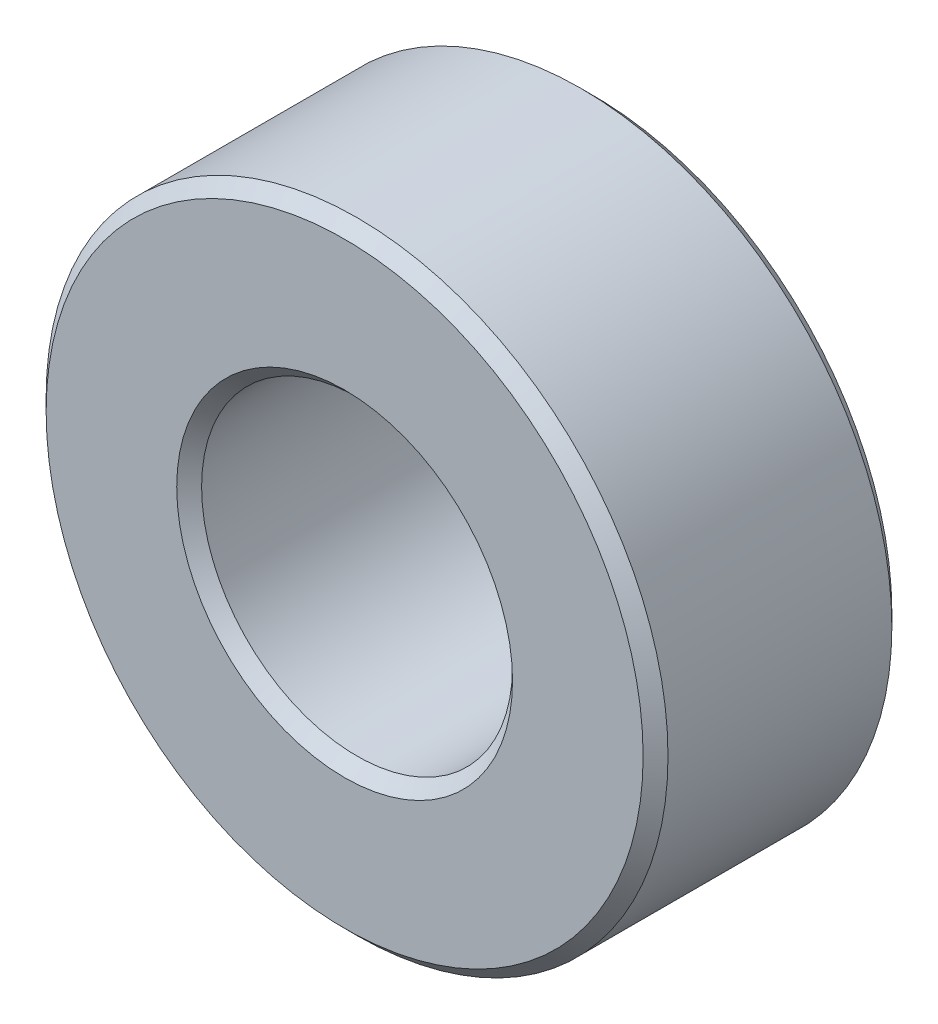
ISO-10303-21;
HEADER;
FILE_DESCRIPTION(('STEP AP214'),'2;1');
FILE_NAME('part.step','',(''),(''),'','','');
FILE_SCHEMA(('AUTOMOTIVE_DESIGN { 1 0 10303 214 1 1 1 1 }'));
ENDSEC;
DATA;
#1=APPLICATION_CONTEXT('core data for automotive mechanical design processes');
#2=APPLICATION_PROTOCOL_DEFINITION('international standard','automotive_design',2000,#1);
#3=PRODUCT_CONTEXT('',#1,'mechanical');
#4=PRODUCT('Part','Part','',(#3));
#5=PRODUCT_RELATED_PRODUCT_CATEGORY('part','',(#4));
#6=PRODUCT_DEFINITION_FORMATION('','',#4);
#7=PRODUCT_DEFINITION_CONTEXT('part definition',#1,'design');
#8=PRODUCT_DEFINITION('design','',#6,#7);
#9=PRODUCT_DEFINITION_SHAPE('','',#8);
#10=(LENGTH_UNIT() NAMED_UNIT(*) SI_UNIT(.MILLI.,.METRE.));
#11=(NAMED_UNIT(*) PLANE_ANGLE_UNIT() SI_UNIT($,.RADIAN.));
#12=(NAMED_UNIT(*) SI_UNIT($,.STERADIAN.) SOLID_ANGLE_UNIT());
#13=UNCERTAINTY_MEASURE_WITH_UNIT(LENGTH_MEASURE(1.E-05),#10,'distance_accuracy_value','');
#14=(GEOMETRIC_REPRESENTATION_CONTEXT(3) GLOBAL_UNCERTAINTY_ASSIGNED_CONTEXT((#13)) GLOBAL_UNIT_ASSIGNED_CONTEXT((#10,
#11,#12)) REPRESENTATION_CONTEXT('',''));
#15=CARTESIAN_POINT('',(0.,0.,0.));
#16=DIRECTION('',(0.,0.,1.));
#17=DIRECTION('',(1.,0.,0.));
#18=AXIS2_PLACEMENT_3D('',#15,#16,#17);
#19=CARTESIAN_POINT('',(0.,0.,1.));
#20=DIRECTION('',(0.,0.,1.));
#21=DIRECTION('',(1.,0.,0.));
#22=AXIS2_PLACEMENT_3D('',#19,#20,#21);
#23=PLANE('',#22);
#24=CARTESIAN_POINT('',(0.,0.,1.));
#25=DIRECTION('',(0.,0.,1.));
#26=DIRECTION('',(1.,0.,0.));
#27=AXIS2_PLACEMENT_3D('',#24,#25,#26);
#28=CIRCLE('',#27,1.35);
#29=CARTESIAN_POINT('',(1.35,0.,1.));
#30=VERTEX_POINT('',#29);
#31=EDGE_CURVE('E10',#30,#30,#28,.F.);
#32=ORIENTED_EDGE('',*,*,#31,.T.);
#33=EDGE_LOOP('',(#32));
#34=FACE_BOUND('',#33,.T.);
#35=CARTESIAN_POINT('',(0.,0.,1.));
#36=DIRECTION('',(0.,0.,1.));
#37=DIRECTION('',(1.,0.,0.));
#38=AXIS2_PLACEMENT_3D('',#35,#36,#37);
#39=CIRCLE('',#38,2.4);
#40=CARTESIAN_POINT('',(2.4,0.,1.));
#41=VERTEX_POINT('',#40);
#42=EDGE_CURVE('E45',#41,#41,#39,.T.);
#43=ORIENTED_EDGE('',*,*,#42,.T.);
#44=EDGE_LOOP('',(#43));
#45=FACE_BOUND('',#44,.T.);
#46=ADVANCED_FACE('F37',(#34,#45),#23,.T.);
#47=CARTESIAN_POINT('',(0.,0.,-1.));
#48=DIRECTION('',(0.,0.,1.));
#49=DIRECTION('',(1.,0.,0.));
#50=AXIS2_PLACEMENT_3D('',#47,#48,#49);
#51=PLANE('',#50);
#52=CARTESIAN_POINT('',(0.,0.,-1.));
#53=DIRECTION('',(0.,0.,1.));
#54=DIRECTION('',(1.,0.,0.));
#55=AXIS2_PLACEMENT_3D('',#52,#53,#54);
#56=CIRCLE('',#55,2.4);
#57=CARTESIAN_POINT('',(2.4,0.,-1.));
#58=VERTEX_POINT('',#57);
#59=EDGE_CURVE('E62',#58,#58,#56,.F.);
#60=ORIENTED_EDGE('',*,*,#59,.T.);
#61=EDGE_LOOP('',(#60));
#62=FACE_BOUND('',#61,.T.);
#63=CARTESIAN_POINT('',(0.,0.,-1.));
#64=DIRECTION('',(0.,0.,1.));
#65=DIRECTION('',(1.,0.,0.));
#66=AXIS2_PLACEMENT_3D('',#63,#64,#65);
#67=CIRCLE('',#66,1.35);
#68=CARTESIAN_POINT('',(-1.35,0.,-1.));
#69=VERTEX_POINT('',#68);
#70=EDGE_CURVE('E66',#69,#69,#67,.T.);
#71=ORIENTED_EDGE('',*,*,#70,.T.);
#72=EDGE_LOOP('',(#71));
#73=FACE_BOUND('',#72,.T.);
#74=ADVANCED_FACE('F89',(#62,#73),#51,.F.);
#75=CARTESIAN_POINT('',(0.,0.,1.));
#76=DIRECTION('',(0.,0.,-1.));
#77=DIRECTION('',(-1.,0.,0.));
#78=AXIS2_PLACEMENT_3D('',#75,#76,#77);
#79=CYLINDRICAL_SURFACE('',#78,2.5);
#80=CARTESIAN_POINT('',(0.,0.,-0.9));
#81=DIRECTION('',(0.,0.,1.));
#82=DIRECTION('',(1.,0.,0.));
#83=AXIS2_PLACEMENT_3D('',#80,#81,#82);
#84=CIRCLE('',#83,2.5);
#85=CARTESIAN_POINT('',(2.5,0.,-0.9));
#86=VERTEX_POINT('',#85);
#87=EDGE_CURVE('E70',#86,#86,#84,.T.);
#88=ORIENTED_EDGE('',*,*,#87,.T.);
#89=EDGE_LOOP('',(#88));
#90=FACE_BOUND('',#89,.T.);
#91=CARTESIAN_POINT('',(0.,0.,0.899999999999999));
#92=DIRECTION('',(0.,0.,1.));
#93=DIRECTION('',(1.,0.,0.));
#94=AXIS2_PLACEMENT_3D('',#91,#92,#93);
#95=CIRCLE('',#94,2.5);
#96=CARTESIAN_POINT('',(2.5,0.,0.899999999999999));
#97=VERTEX_POINT('',#96);
#98=EDGE_CURVE('E74',#97,#97,#95,.F.);
#99=ORIENTED_EDGE('',*,*,#98,.T.);
#100=EDGE_LOOP('',(#99));
#101=FACE_BOUND('',#100,.T.);
#102=ADVANCED_FACE('F78',(#90,#101),#79,.T.);
#103=CARTESIAN_POINT('',(0.,0.,1.));
#104=DIRECTION('',(0.,0.,-1.));
#105=DIRECTION('',(-1.,0.,0.));
#106=AXIS2_PLACEMENT_3D('',#103,#104,#105);
#107=CYLINDRICAL_SURFACE('',#106,1.25);
#108=CARTESIAN_POINT('',(0.,0.,-0.9));
#109=DIRECTION('',(0.,0.,1.));
#110=DIRECTION('',(1.,0.,0.));
#111=AXIS2_PLACEMENT_3D('',#108,#109,#110);
#112=CIRCLE('',#111,1.25);
#113=CARTESIAN_POINT('',(-1.25,0.,-0.9));
#114=VERTEX_POINT('',#113);
#115=EDGE_CURVE('E51',#114,#114,#112,.F.);
#116=ORIENTED_EDGE('',*,*,#115,.T.);
#117=EDGE_LOOP('',(#116));
#118=FACE_BOUND('',#117,.T.);
#119=CARTESIAN_POINT('',(0.,0.,0.899999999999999));
#120=DIRECTION('',(0.,0.,1.));
#121=DIRECTION('',(1.,0.,0.));
#122=AXIS2_PLACEMENT_3D('',#119,#120,#121);
#123=CIRCLE('',#122,1.25);
#124=CARTESIAN_POINT('',(1.25,0.,0.899999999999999));
#125=VERTEX_POINT('',#124);
#126=EDGE_CURVE('E57',#125,#125,#123,.T.);
#127=ORIENTED_EDGE('',*,*,#126,.T.);
#128=EDGE_LOOP('',(#127));
#129=FACE_BOUND('',#128,.T.);
#130=ADVANCED_FACE('F97',(#118,#129),#107,.F.);
#131=CARTESIAN_POINT('',(0.,0.,-0.9));
#132=DIRECTION('',(0.,0.,1.));
#133=DIRECTION('',(1.,0.,0.));
#134=AXIS2_PLACEMENT_3D('',#131,#132,#133);
#135=CONICAL_SURFACE('',#134,2.5,0.785398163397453);
#136=CARTESIAN_POINT('',(2.4,0.,-1.));
#137=CARTESIAN_POINT('',(2.40104166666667,0.,-0.998958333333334));
#138=CARTESIAN_POINT('',(2.40208333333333,0.,-0.997916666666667));
#139=CARTESIAN_POINT('',(2.40416666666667,0.,-0.995833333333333));
#140=CARTESIAN_POINT('',(2.40520833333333,0.,-0.994791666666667));
#141=CARTESIAN_POINT('',(2.40729166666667,0.,-0.992708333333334));
#142=CARTESIAN_POINT('',(2.40833333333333,0.,-0.991666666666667));
#143=CARTESIAN_POINT('',(2.41041666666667,0.,-0.989583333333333));
#144=CARTESIAN_POINT('',(2.41145833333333,0.,-0.988541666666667));
#145=CARTESIAN_POINT('',(2.41354166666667,0.,-0.986458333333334));
#146=CARTESIAN_POINT('',(2.41458333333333,0.,-0.985416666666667));
#147=CARTESIAN_POINT('',(2.41666666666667,0.,-0.983333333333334));
#148=CARTESIAN_POINT('',(2.41770833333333,0.,-0.982291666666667));
#149=CARTESIAN_POINT('',(2.41979166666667,0.,-0.980208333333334));
#150=CARTESIAN_POINT('',(2.42083333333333,0.,-0.979166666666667));
#151=CARTESIAN_POINT('',(2.42291666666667,0.,-0.977083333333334));
#152=CARTESIAN_POINT('',(2.42395833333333,0.,-0.976041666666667));
#153=CARTESIAN_POINT('',(2.42604166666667,0.,-0.973958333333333));
#154=CARTESIAN_POINT('',(2.42708333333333,0.,-0.972916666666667));
#155=CARTESIAN_POINT('',(2.42916666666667,0.,-0.970833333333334));
#156=CARTESIAN_POINT('',(2.43020833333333,0.,-0.969791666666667));
#157=CARTESIAN_POINT('',(2.43229166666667,0.,-0.967708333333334));
#158=CARTESIAN_POINT('',(2.43333333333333,0.,-0.966666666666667));
#159=CARTESIAN_POINT('',(2.43541666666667,0.,-0.964583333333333));
#160=CARTESIAN_POINT('',(2.43645833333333,0.,-0.963541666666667));
#161=CARTESIAN_POINT('',(2.43854166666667,0.,-0.961458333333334));
#162=CARTESIAN_POINT('',(2.43958333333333,0.,-0.960416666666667));
#163=CARTESIAN_POINT('',(2.44166666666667,0.,-0.958333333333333));
#164=CARTESIAN_POINT('',(2.44270833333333,0.,-0.957291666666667));
#165=CARTESIAN_POINT('',(2.44479166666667,0.,-0.955208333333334));
#166=CARTESIAN_POINT('',(2.44583333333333,0.,-0.954166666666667));
#167=CARTESIAN_POINT('',(2.44791666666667,0.,-0.952083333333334));
#168=CARTESIAN_POINT('',(2.44895833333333,0.,-0.951041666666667));
#169=CARTESIAN_POINT('',(2.45104166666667,0.,-0.948958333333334));
#170=CARTESIAN_POINT('',(2.45208333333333,0.,-0.947916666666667));
#171=CARTESIAN_POINT('',(2.45416666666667,0.,-0.945833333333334));
#172=CARTESIAN_POINT('',(2.45520833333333,0.,-0.944791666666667));
#173=CARTESIAN_POINT('',(2.45729166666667,0.,-0.942708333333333));
#174=CARTESIAN_POINT('',(2.45833333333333,0.,-0.941666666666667));
#175=CARTESIAN_POINT('',(2.46041666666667,0.,-0.939583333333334));
#176=CARTESIAN_POINT('',(2.46145833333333,0.,-0.938541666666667));
#177=CARTESIAN_POINT('',(2.46354166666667,0.,-0.936458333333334));
#178=CARTESIAN_POINT('',(2.46458333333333,0.,-0.935416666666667));
#179=CARTESIAN_POINT('',(2.46666666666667,0.,-0.933333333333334));
#180=CARTESIAN_POINT('',(2.46770833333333,0.,-0.932291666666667));
#181=CARTESIAN_POINT('',(2.46979166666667,0.,-0.930208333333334));
#182=CARTESIAN_POINT('',(2.47083333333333,0.,-0.929166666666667));
#183=CARTESIAN_POINT('',(2.47291666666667,0.,-0.927083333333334));
#184=CARTESIAN_POINT('',(2.47395833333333,0.,-0.926041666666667));
#185=CARTESIAN_POINT('',(2.47604166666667,0.,-0.923958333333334));
#186=CARTESIAN_POINT('',(2.47708333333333,0.,-0.922916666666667));
#187=CARTESIAN_POINT('',(2.47916666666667,0.,-0.920833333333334));
#188=CARTESIAN_POINT('',(2.48020833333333,0.,-0.919791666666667));
#189=CARTESIAN_POINT('',(2.48229166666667,0.,-0.917708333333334));
#190=CARTESIAN_POINT('',(2.48333333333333,0.,-0.916666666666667));
#191=CARTESIAN_POINT('',(2.48541666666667,0.,-0.914583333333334));
#192=CARTESIAN_POINT('',(2.48645833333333,0.,-0.913541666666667));
#193=CARTESIAN_POINT('',(2.48854166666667,0.,-0.911458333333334));
#194=CARTESIAN_POINT('',(2.48958333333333,0.,-0.910416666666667));
#195=CARTESIAN_POINT('',(2.49166666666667,0.,-0.908333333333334));
#196=CARTESIAN_POINT('',(2.49270833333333,0.,-0.907291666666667));
#197=CARTESIAN_POINT('',(2.49479166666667,0.,-0.905208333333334));
#198=CARTESIAN_POINT('',(2.49583333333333,0.,-0.904166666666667));
#199=CARTESIAN_POINT('',(2.49791666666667,0.,-0.902083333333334));
#200=CARTESIAN_POINT('',(2.49895833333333,0.,-0.901041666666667));
#201=CARTESIAN_POINT('',(2.5,0.,-0.9));
#202=B_SPLINE_CURVE_WITH_KNOTS('',3,(#136,#137,#138,#139,#140,#141,#142,#143,#144,#145,#146,
#147,#148,#149,#150,#151,#152,#153,#154,#155,#156,#157,#158,#159,#160,#161,#162,#163,#164,#165,
#166,#167,#168,#169,#170,#171,#172,#173,#174,#175,#176,#177,#178,#179,#180,#181,#182,#183,#184,
#185,#186,#187,#188,#189,#190,#191,#192,#193,#194,#195,#196,#197,#198,#199,#200,#201),
.UNSPECIFIED.,.F.,.F.,(4,2,2,2,2,2,2,2,2,2,2,2,2,2,2,2,2,2,2,2,2,2,2,2,2,2,2,2,2,2,2,2,4),(0.,
0.00441941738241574,0.00883883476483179,0.0132582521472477,0.0176776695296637,
0.0220970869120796,0.0265165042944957,0.0309359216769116,0.0353553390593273,0.0397747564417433,
0.0441941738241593,0.0486135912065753,0.0530330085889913,0.0574524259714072,0.0618718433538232,
0.0662912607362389,0.0707106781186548,0.0751300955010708,0.0795495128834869,0.0839689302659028,
0.0883883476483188,0.0928077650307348,0.0972271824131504,0.101646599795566,0.106066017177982,
0.110485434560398,0.114904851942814,0.11932426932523,0.123743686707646,0.128163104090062,
0.132582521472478,0.137001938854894,0.14142135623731),.UNSPECIFIED.);
#203=EDGE_CURVE('BSEAM102',#58,#86,#202,.T.);
#204=ORIENTED_EDGE('',*,*,#59,.F.);
#205=ORIENTED_EDGE('',*,*,#87,.F.);
#206=ORIENTED_EDGE('',*,*,#203,.T.);
#207=ORIENTED_EDGE('',*,*,#203,.F.);
#208=EDGE_LOOP('',(#204,#206,#205,#207));
#209=FACE_BOUND('',#208,.T.);
#210=ADVANCED_FACE('F102',(#209),#135,.T.);
#211=CARTESIAN_POINT('',(0.,0.,-1.));
#212=DIRECTION('',(0.,0.,-1.));
#213=DIRECTION('',(-1.,0.,0.));
#214=AXIS2_PLACEMENT_3D('',#211,#212,#213);
#215=CONICAL_SURFACE('',#214,1.35,0.785398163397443);
#216=CARTESIAN_POINT('',(-1.25,0.,-0.9));
#217=CARTESIAN_POINT('',(-1.25104166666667,0.,-0.901041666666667));
#218=CARTESIAN_POINT('',(-1.25208333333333,0.,-0.902083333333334));
#219=CARTESIAN_POINT('',(-1.25416666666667,0.,-0.904166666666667));
#220=CARTESIAN_POINT('',(-1.25520833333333,0.,-0.905208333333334));
#221=CARTESIAN_POINT('',(-1.25729166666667,0.,-0.907291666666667));
#222=CARTESIAN_POINT('',(-1.25833333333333,0.,-0.908333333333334));
#223=CARTESIAN_POINT('',(-1.26041666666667,0.,-0.910416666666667));
#224=CARTESIAN_POINT('',(-1.26145833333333,0.,-0.911458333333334));
#225=CARTESIAN_POINT('',(-1.26354166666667,0.,-0.913541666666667));
#226=CARTESIAN_POINT('',(-1.26458333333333,0.,-0.914583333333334));
#227=CARTESIAN_POINT('',(-1.26666666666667,0.,-0.916666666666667));
#228=CARTESIAN_POINT('',(-1.26770833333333,0.,-0.917708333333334));
#229=CARTESIAN_POINT('',(-1.26979166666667,0.,-0.919791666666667));
#230=CARTESIAN_POINT('',(-1.27083333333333,0.,-0.920833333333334));
#231=CARTESIAN_POINT('',(-1.27291666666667,0.,-0.922916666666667));
#232=CARTESIAN_POINT('',(-1.27395833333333,0.,-0.923958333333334));
#233=CARTESIAN_POINT('',(-1.27604166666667,0.,-0.926041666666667));
#234=CARTESIAN_POINT('',(-1.27708333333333,0.,-0.927083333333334));
#235=CARTESIAN_POINT('',(-1.27916666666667,0.,-0.929166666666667));
#236=CARTESIAN_POINT('',(-1.28020833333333,0.,-0.930208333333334));
#237=CARTESIAN_POINT('',(-1.28229166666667,0.,-0.932291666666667));
#238=CARTESIAN_POINT('',(-1.28333333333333,0.,-0.933333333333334));
#239=CARTESIAN_POINT('',(-1.28541666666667,0.,-0.935416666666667));
#240=CARTESIAN_POINT('',(-1.28645833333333,0.,-0.936458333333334));
#241=CARTESIAN_POINT('',(-1.28854166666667,0.,-0.938541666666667));
#242=CARTESIAN_POINT('',(-1.28958333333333,0.,-0.939583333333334));
#243=CARTESIAN_POINT('',(-1.29166666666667,0.,-0.941666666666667));
#244=CARTESIAN_POINT('',(-1.29270833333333,0.,-0.942708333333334));
#245=CARTESIAN_POINT('',(-1.29479166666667,0.,-0.944791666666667));
#246=CARTESIAN_POINT('',(-1.29583333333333,0.,-0.945833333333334));
#247=CARTESIAN_POINT('',(-1.29791666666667,0.,-0.947916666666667));
#248=CARTESIAN_POINT('',(-1.29895833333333,0.,-0.948958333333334));
#249=CARTESIAN_POINT('',(-1.30104166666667,0.,-0.951041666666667));
#250=CARTESIAN_POINT('',(-1.30208333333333,0.,-0.952083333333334));
#251=CARTESIAN_POINT('',(-1.30416666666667,0.,-0.954166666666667));
#252=CARTESIAN_POINT('',(-1.30520833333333,0.,-0.955208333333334));
#253=CARTESIAN_POINT('',(-1.30729166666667,0.,-0.957291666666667));
#254=CARTESIAN_POINT('',(-1.30833333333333,0.,-0.958333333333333));
#255=CARTESIAN_POINT('',(-1.31041666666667,0.,-0.960416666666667));
#256=CARTESIAN_POINT('',(-1.31145833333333,0.,-0.961458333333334));
#257=CARTESIAN_POINT('',(-1.31354166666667,0.,-0.963541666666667));
#258=CARTESIAN_POINT('',(-1.31458333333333,0.,-0.964583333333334));
#259=CARTESIAN_POINT('',(-1.31666666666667,0.,-0.966666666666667));
#260=CARTESIAN_POINT('',(-1.31770833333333,0.,-0.967708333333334));
#261=CARTESIAN_POINT('',(-1.31979166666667,0.,-0.969791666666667));
#262=CARTESIAN_POINT('',(-1.32083333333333,0.,-0.970833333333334));
#263=CARTESIAN_POINT('',(-1.32291666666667,0.,-0.972916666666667));
#264=CARTESIAN_POINT('',(-1.32395833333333,0.,-0.973958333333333));
#265=CARTESIAN_POINT('',(-1.32604166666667,0.,-0.976041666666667));
#266=CARTESIAN_POINT('',(-1.32708333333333,0.,-0.977083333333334));
#267=CARTESIAN_POINT('',(-1.32916666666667,0.,-0.979166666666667));
#268=CARTESIAN_POINT('',(-1.33020833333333,0.,-0.980208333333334));
#269=CARTESIAN_POINT('',(-1.33229166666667,0.,-0.982291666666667));
#270=CARTESIAN_POINT('',(-1.33333333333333,0.,-0.983333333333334));
#271=CARTESIAN_POINT('',(-1.33541666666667,0.,-0.985416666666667));
#272=CARTESIAN_POINT('',(-1.33645833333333,0.,-0.986458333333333));
#273=CARTESIAN_POINT('',(-1.33854166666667,0.,-0.988541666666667));
#274=CARTESIAN_POINT('',(-1.33958333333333,0.,-0.989583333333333));
#275=CARTESIAN_POINT('',(-1.34166666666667,0.,-0.991666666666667));
#276=CARTESIAN_POINT('',(-1.34270833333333,0.,-0.992708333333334));
#277=CARTESIAN_POINT('',(-1.34479166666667,0.,-0.994791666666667));
#278=CARTESIAN_POINT('',(-1.34583333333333,0.,-0.995833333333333));
#279=CARTESIAN_POINT('',(-1.34791666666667,0.,-0.997916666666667));
#280=CARTESIAN_POINT('',(-1.34895833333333,0.,-0.998958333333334));
#281=CARTESIAN_POINT('',(-1.35,0.,-1.));
#282=B_SPLINE_CURVE_WITH_KNOTS('',3,(#216,#217,#218,#219,#220,#221,#222,#223,#224,#225,#226,
#227,#228,#229,#230,#231,#232,#233,#234,#235,#236,#237,#238,#239,#240,#241,#242,#243,#244,#245,
#246,#247,#248,#249,#250,#251,#252,#253,#254,#255,#256,#257,#258,#259,#260,#261,#262,#263,#264,
#265,#266,#267,#268,#269,#270,#271,#272,#273,#274,#275,#276,#277,#278,#279,#280,#281),
.UNSPECIFIED.,.F.,.F.,(4,2,2,2,2,2,2,2,2,2,2,2,2,2,2,2,2,2,2,2,2,2,2,2,2,2,2,2,2,2,2,2,4),(0.,
0.00441941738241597,0.00883883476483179,0.0132582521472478,0.0176776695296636,
0.0220970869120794,0.0265165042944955,0.0309359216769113,0.0353553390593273,0.0397747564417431,
0.0441941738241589,0.0486135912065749,0.0530330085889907,0.0574524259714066,0.0618718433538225,
0.0662912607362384,0.0707106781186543,0.0751300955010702,0.0795495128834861,0.0839689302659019,
0.0883883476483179,0.0928077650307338,0.0972271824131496,0.101646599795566,0.106066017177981,
0.110485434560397,0.114904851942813,0.119324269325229,0.123743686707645,0.128163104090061,
0.132582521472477,0.137001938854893,0.141421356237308),.UNSPECIFIED.);
#283=EDGE_CURVE('BSEAM86',#114,#69,#282,.T.);
#284=ORIENTED_EDGE('',*,*,#115,.F.);
#285=ORIENTED_EDGE('',*,*,#70,.F.);
#286=ORIENTED_EDGE('',*,*,#283,.T.);
#287=ORIENTED_EDGE('',*,*,#283,.F.);
#288=EDGE_LOOP('',(#284,#286,#285,#287));
#289=FACE_BOUND('',#288,.T.);
#290=ADVANCED_FACE('F86',(#289),#215,.F.);
#291=CARTESIAN_POINT('',(0.,0.,0.899999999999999));
#292=DIRECTION('',(0.,0.,1.));
#293=DIRECTION('',(1.,0.,0.));
#294=AXIS2_PLACEMENT_3D('',#291,#292,#293);
#295=CONICAL_SURFACE('',#294,1.25,0.785398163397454);
#296=ORIENTED_EDGE('',*,*,#31,.F.);
#297=EDGE_LOOP('',(#296));
#298=FACE_BOUND('',#297,.T.);
#299=ORIENTED_EDGE('',*,*,#126,.F.);
#300=EDGE_LOOP('',(#299));
#301=FACE_BOUND('',#300,.T.);
#302=ADVANCED_FACE('F82',(#298,#301),#295,.F.);
#303=CARTESIAN_POINT('',(0.,0.,1.));
#304=DIRECTION('',(0.,0.,-1.));
#305=DIRECTION('',(-1.,0.,0.));
#306=AXIS2_PLACEMENT_3D('',#303,#304,#305);
#307=CONICAL_SURFACE('',#306,2.4,0.785398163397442);
#308=ORIENTED_EDGE('',*,*,#98,.F.);
#309=EDGE_LOOP('',(#308));
#310=FACE_BOUND('',#309,.T.);
#311=ORIENTED_EDGE('',*,*,#42,.F.);
#312=EDGE_LOOP('',(#311));
#313=FACE_BOUND('',#312,.T.);
#314=ADVANCED_FACE('F39',(#310,#313),#307,.T.);
#315=CLOSED_SHELL('',(#46,#74,#102,#130,#210,#290,#302,#314));
#316=MANIFOLD_SOLID_BREP('B2',#315);
#317=ADVANCED_BREP_SHAPE_REPRESENTATION('',(#18,#316),#14);
#318=SHAPE_DEFINITION_REPRESENTATION(#9,#317);
ENDSEC;
END-ISO-10303-21;
